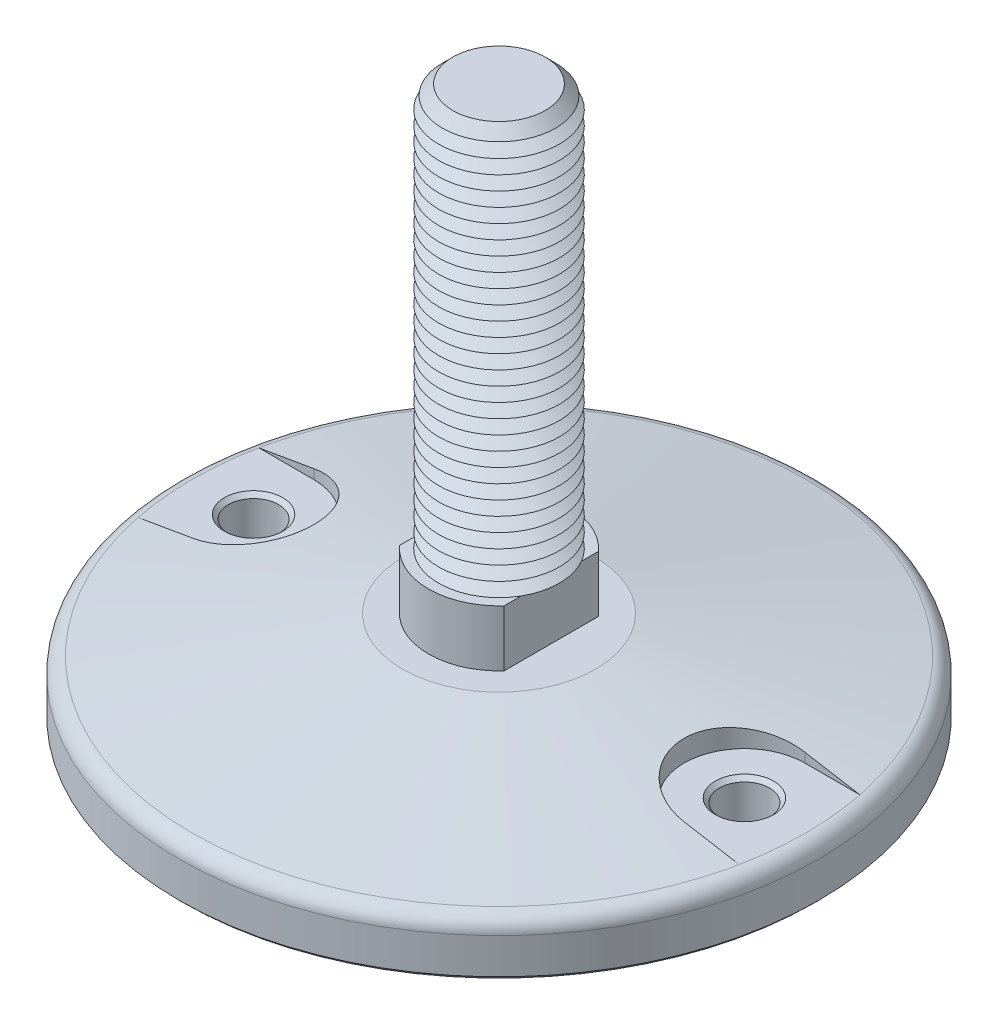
from build123d import *

# Parameters (mm, degrees)
FILLET1_R                = 4
SKETCH3_R                = 17.5
BOSS_EXTRUDE1_DEPTH      = 14
CUT_EXTRUDE1_START       = -14
CUT_EXTRUDE1_DEPTH       = 14
SKETCH5_R                = 15
BOSS_EXTRUDE2_DEPTH      = 100
CHAMFER1_SIZE            = 3.5
LPATTERN1_COUNT          = 28
LPATTERN1_PITCH          = 3.5
CUT_EXTRUDE4_DEPTH       = 9.2
SKETCH10_R               = 6.25
CUT_EXTRUDE5_DEPTH       = 13.8
CHAMFER2_SIZE            = 1
CHAMFER2_OF_MIRROR1_SIZE = 1
CHAMFER3_SIZE            = 1


with BuildPart() as part:
    # Sketch2 → Revolve1 (revolve)
    with BuildSketch(Plane(origin=(0, 0, 0), x_dir=(0, 0, -1), z_dir=(1, 0, 0)), mode=Mode.PRIVATE) as revolve1_sk:
        Polygon((0, 0), (-24, 0), (-79.5, -9.786147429), (-79.5, -23), (0, -23), align=None)
    revolve(revolve1_sk.sketch.rotate(Axis((0, 61.338865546, 0), (0, -1, 0)), 180), axis=Axis((0, 61.338865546, 0), (0, -1, 0)))

    # Fillet1
    fillet1_edges = [part.edges().sort_by_distance(p)[0] for p in [
        (0, -9.786147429, 79.5),
    ]]
    fillet(fillet1_edges, radius=FILLET1_R)

    # Sketch3 → Boss-Extrude1 (add)
    with BuildSketch(Plane(origin=(0, 0, 0), x_dir=(1, 0, 0), z_dir=(0, 1, 0))):
        with Locations(Location((0, 0, 0), (0, 0, 270))):
            Circle(SKETCH3_R)
    extrude(amount=BOSS_EXTRUDE1_DEPTH)

    # Sketch4 → Cut-Extrude1 (cut)
    with BuildSketch(Plane(origin=(0, 14, 0), x_dir=(1, 0, 0), z_dir=(0, 1, 0)).offset(CUT_EXTRUDE1_START)):
        with BuildLine():
            Line((-13, 11.715374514), (-13, -11.715374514))
            ThreePointArc((-13, -11.715374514), (-17.5, 0), (-13, 11.715374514))
        make_face()
        with BuildLine():
            Line((13, -11.715374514), (13, 11.715374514))
            ThreePointArc((13, 11.715374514), (17.5, 0), (13, -11.715374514))
        make_face()
    extrude(amount=CUT_EXTRUDE1_DEPTH, mode=Mode.SUBTRACT)

    # Sketch5 → Boss-Extrude2 (add)
    with BuildSketch(Plane(origin=(0, 14, 0), x_dir=(1, 0, 0), z_dir=(0, 1, 0))):
        with Locations(Location((0, 0, 0), (0, 0, 29.926434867))):
            Circle(SKETCH5_R)
    extrude(amount=BOSS_EXTRUDE2_DEPTH)

    # Chamfer1
    chamfer1_edges = [part.edges().sort_by_distance(p)[0] for p in [
        (-13, 114, 7.483314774),
    ]]
    chamfer(chamfer1_edges, length=CHAMFER1_SIZE)

    # Sketch6 → Cut-Revolve1 (revolve, cut)
    with BuildSketch(Plane(origin=(0, 0, 0), x_dir=(0, 0, -1), z_dir=(1, 0, 0))):
        Polygon((-15, 14), (-11.968911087, 15.75), (-15, 17.5), align=None)
    cut_revolve1 = revolve(axis=Axis((0, 61.338865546, 0), (0, -1, 0)), mode=Mode.SUBTRACT)

    # LPattern1: Cut-Revolve1 ×28
    with Locations(*[(0, i * LPATTERN1_PITCH, 0) for i in range(1, LPATTERN1_COUNT)]):
        add(cut_revolve1, mode=Mode.SUBTRACT)

    # Sketch8 → Cut-Extrude4 (cut)
    with BuildSketch(Plane(origin=(0, 0, 0), x_dir=(1, 0, 0), z_dir=(0, 1, 0))):
        with BuildLine():
            Line((-61, 15), (-74.703520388, 15))
            ThreePointArc((-74.703520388, 15), (-76.194592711, 0), (-74.703520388, -15))
            Line((-74.703520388, -15), (-61, -15))
            ThreePointArc((-61, -15), (-46, 0), (-61, 15))
        make_face()
    cut_extrude4 = extrude(amount=-CUT_EXTRUDE4_DEPTH, mode=Mode.SUBTRACT)

    # Sketch10 → Cut-Extrude5 (cut)
    with BuildSketch(Plane(origin=(0, -9.2, 0), x_dir=(1, 0, 0), z_dir=(0, 1, 0))):
        with Locations(Location((-61, 0, 0), (0, 0, 270))):
            Circle(SKETCH10_R)
    cut_extrude5 = extrude(amount=-CUT_EXTRUDE5_DEPTH, mode=Mode.SUBTRACT)

    # Chamfer2
    chamfer2_edges = [part.edges().sort_by_distance(p)[0] for p in [
        (-61, -9.2, -6.25),
        (-61, -23, -6.25),
    ]]
    chamfer(chamfer2_edges, length=CHAMFER2_SIZE)

    # Mirror1: Cut-Extrude4, Cut-Extrude5 across plane
    add(cut_extrude4.mirror(Plane(origin=(0, 0, 0), x_dir=(0, 0, 1), z_dir=(1, 0, 0))), mode=Mode.SUBTRACT)
    add(cut_extrude5.mirror(Plane(origin=(0, 0, 0), x_dir=(0, 0, 1), z_dir=(1, 0, 0))), mode=Mode.SUBTRACT)

    # Chamfer2 of Mirror1
    chamfer2_of_mirror1_edges = [part.edges().sort_by_distance(p)[0] for p in [
        (61, -9.2, -6.25),
        (61, -23, -6.25),
    ]]
    chamfer(chamfer2_of_mirror1_edges, length=CHAMFER2_OF_MIRROR1_SIZE)

    # Chamfer3
    chamfer3_edges = [part.edges().sort_by_distance(p)[0] for p in [
        (0, -23, 79.5),
    ]]
    chamfer(chamfer3_edges, length=CHAMFER3_SIZE)


solid = part.part
